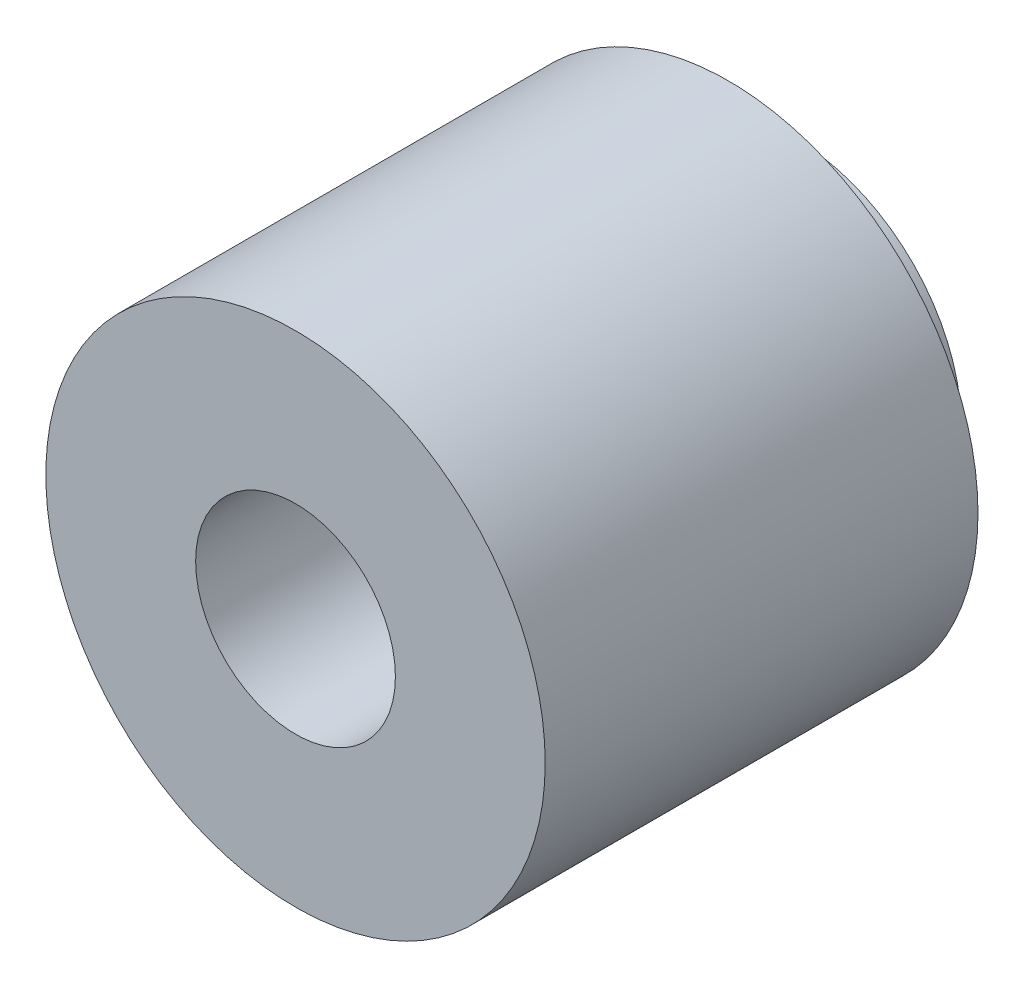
ISO-10303-21;
HEADER;
FILE_DESCRIPTION(('STEP AP214'),'2;1');
FILE_NAME('part.step','',(''),(''),'','','');
FILE_SCHEMA(('AUTOMOTIVE_DESIGN { 1 0 10303 214 1 1 1 1 }'));
ENDSEC;
DATA;
#1=APPLICATION_CONTEXT('core data for automotive mechanical design processes');
#2=APPLICATION_PROTOCOL_DEFINITION('international standard','automotive_design',2000,#1);
#3=PRODUCT_CONTEXT('',#1,'mechanical');
#4=PRODUCT('Part','Part','',(#3));
#5=PRODUCT_RELATED_PRODUCT_CATEGORY('part','',(#4));
#6=PRODUCT_DEFINITION_FORMATION('','',#4);
#7=PRODUCT_DEFINITION_CONTEXT('part definition',#1,'design');
#8=PRODUCT_DEFINITION('design','',#6,#7);
#9=PRODUCT_DEFINITION_SHAPE('','',#8);
#10=(LENGTH_UNIT() NAMED_UNIT(*) SI_UNIT(.MILLI.,.METRE.));
#11=(NAMED_UNIT(*) PLANE_ANGLE_UNIT() SI_UNIT($,.RADIAN.));
#12=(NAMED_UNIT(*) SI_UNIT($,.STERADIAN.) SOLID_ANGLE_UNIT());
#13=UNCERTAINTY_MEASURE_WITH_UNIT(LENGTH_MEASURE(1.E-05),#10,'distance_accuracy_value','');
#14=(GEOMETRIC_REPRESENTATION_CONTEXT(3) GLOBAL_UNCERTAINTY_ASSIGNED_CONTEXT((#13)) GLOBAL_UNIT_ASSIGNED_CONTEXT((#10,
#11,#12)) REPRESENTATION_CONTEXT('',''));
#15=CARTESIAN_POINT('',(0.,0.,0.));
#16=DIRECTION('',(0.,0.,1.));
#17=DIRECTION('',(1.,0.,0.));
#18=AXIS2_PLACEMENT_3D('',#15,#16,#17);
#19=CARTESIAN_POINT('',(0.,0.,50.));
#20=DIRECTION('',(0.,0.,1.));
#21=DIRECTION('',(1.,0.,0.));
#22=AXIS2_PLACEMENT_3D('',#19,#20,#21);
#23=CYLINDRICAL_SURFACE('',#22,15.);
#24=CARTESIAN_POINT('',(0.,0.,30.));
#25=DIRECTION('',(0.,0.,1.));
#26=DIRECTION('',(1.,0.,0.));
#27=AXIS2_PLACEMENT_3D('',#24,#25,#26);
#28=CIRCLE('',#27,15.);
#29=CARTESIAN_POINT('',(15.,0.,30.));
#30=VERTEX_POINT('',#29);
#31=EDGE_CURVE('E8',#30,#30,#28,.T.);
#32=ORIENTED_EDGE('',*,*,#31,.F.);
#33=EDGE_LOOP('',(#32));
#34=FACE_BOUND('',#33,.T.);
#35=CARTESIAN_POINT('',(0.,0.,4.));
#36=DIRECTION('',(0.,0.,-1.));
#37=DIRECTION('',(-1.,0.,0.));
#38=AXIS2_PLACEMENT_3D('',#35,#36,#37);
#39=CIRCLE('',#38,15.);
#40=CARTESIAN_POINT('',(-15.,0.,4.));
#41=VERTEX_POINT('',#40);
#42=EDGE_CURVE('E28',#41,#41,#39,.F.);
#43=ORIENTED_EDGE('',*,*,#42,.T.);
#44=EDGE_LOOP('',(#43));
#45=FACE_BOUND('',#44,.T.);
#46=ADVANCED_FACE('F12',(#34,#45),#23,.T.);
#47=CARTESIAN_POINT('',(0.,0.,30.));
#48=DIRECTION('',(0.,0.,1.));
#49=DIRECTION('',(1.,0.,0.));
#50=AXIS2_PLACEMENT_3D('',#47,#48,#49);
#51=PLANE('',#50);
#52=ORIENTED_EDGE('',*,*,#31,.T.);
#53=EDGE_LOOP('',(#52));
#54=FACE_BOUND('',#53,.T.);
#55=CARTESIAN_POINT('',(0.,0.,30.));
#56=DIRECTION('',(0.,0.,-1.));
#57=DIRECTION('',(-1.,0.,0.));
#58=AXIS2_PLACEMENT_3D('',#55,#56,#57);
#59=CIRCLE('',#58,6.);
#60=CARTESIAN_POINT('',(-6.,0.,30.));
#61=VERTEX_POINT('',#60);
#62=EDGE_CURVE('E25',#61,#61,#59,.T.);
#63=ORIENTED_EDGE('',*,*,#62,.T.);
#64=EDGE_LOOP('',(#63));
#65=FACE_BOUND('',#64,.T.);
#66=ADVANCED_FACE('F41',(#54,#65),#51,.T.);
#67=CARTESIAN_POINT('',(0.,0.,21.5));
#68=DIRECTION('',(0.,0.,1.));
#69=DIRECTION('',(1.,0.,0.));
#70=AXIS2_PLACEMENT_3D('',#67,#68,#69);
#71=CYLINDRICAL_SURFACE('',#70,6.);
#72=CARTESIAN_POINT('',(0.,0.,21.5));
#73=DIRECTION('',(0.,0.,-1.));
#74=DIRECTION('',(-1.,0.,0.));
#75=AXIS2_PLACEMENT_3D('',#72,#73,#74);
#76=CIRCLE('',#75,6.);
#77=CARTESIAN_POINT('',(-6.,0.,21.5));
#78=VERTEX_POINT('',#77);
#79=EDGE_CURVE('E20',#78,#78,#76,.T.);
#80=ORIENTED_EDGE('',*,*,#79,.T.);
#81=EDGE_LOOP('',(#80));
#82=FACE_BOUND('',#81,.T.);
#83=ORIENTED_EDGE('',*,*,#62,.F.);
#84=EDGE_LOOP('',(#83));
#85=FACE_BOUND('',#84,.T.);
#86=ADVANCED_FACE('F43',(#82,#85),#71,.F.);
#87=CARTESIAN_POINT('',(0.,0.,21.5));
#88=DIRECTION('',(0.,0.,-1.));
#89=DIRECTION('',(-1.,0.,0.));
#90=AXIS2_PLACEMENT_3D('',#87,#88,#89);
#91=PLANE('',#90);
#92=ORIENTED_EDGE('',*,*,#79,.F.);
#93=EDGE_LOOP('',(#92));
#94=FACE_BOUND('',#93,.T.);
#95=ADVANCED_FACE('F45',(#94),#91,.F.);
#96=CARTESIAN_POINT('',(0.,10.,4.));
#97=DIRECTION('',(0.,0.,-1.));
#98=DIRECTION('',(-1.,0.,0.));
#99=AXIS2_PLACEMENT_3D('',#96,#97,#98);
#100=PLANE('',#99);
#101=ORIENTED_EDGE('',*,*,#42,.F.);
#102=EDGE_LOOP('',(#101));
#103=FACE_BOUND('',#102,.T.);
#104=CARTESIAN_POINT('',(0.,0.,4.));
#105=DIRECTION('',(0.,0.,-1.));
#106=DIRECTION('',(-1.,0.,0.));
#107=AXIS2_PLACEMENT_3D('',#104,#105,#106);
#108=CIRCLE('',#107,10.);
#109=CARTESIAN_POINT('',(-10.,0.,4.));
#110=VERTEX_POINT('',#109);
#111=EDGE_CURVE('E30',#110,#110,#108,.T.);
#112=ORIENTED_EDGE('',*,*,#111,.F.);
#113=EDGE_LOOP('',(#112));
#114=FACE_BOUND('',#113,.T.);
#115=ADVANCED_FACE('F48',(#103,#114),#100,.T.);
#116=CARTESIAN_POINT('',(0.,0.,-10.));
#117=DIRECTION('',(0.,0.,-1.));
#118=DIRECTION('',(-1.,0.,0.));
#119=AXIS2_PLACEMENT_3D('',#116,#117,#118);
#120=CYLINDRICAL_SURFACE('',#119,10.);
#121=CARTESIAN_POINT('',(0.,0.,0.));
#122=DIRECTION('',(0.,0.,-1.));
#123=DIRECTION('',(-1.,0.,0.));
#124=AXIS2_PLACEMENT_3D('',#121,#122,#123);
#125=CIRCLE('',#124,10.);
#126=CARTESIAN_POINT('',(-10.,0.,0.));
#127=VERTEX_POINT('',#126);
#128=EDGE_CURVE('E16',#127,#127,#125,.F.);
#129=ORIENTED_EDGE('',*,*,#128,.T.);
#130=EDGE_LOOP('',(#129));
#131=FACE_BOUND('',#130,.T.);
#132=ORIENTED_EDGE('',*,*,#111,.T.);
#133=EDGE_LOOP('',(#132));
#134=FACE_BOUND('',#133,.T.);
#135=ADVANCED_FACE('F58',(#131,#134),#120,.T.);
#136=CARTESIAN_POINT('',(15.,0.,0.));
#137=DIRECTION('',(0.,0.,-1.));
#138=DIRECTION('',(-1.,0.,0.));
#139=AXIS2_PLACEMENT_3D('',#136,#137,#138);
#140=PLANE('',#139);
#141=ORIENTED_EDGE('',*,*,#128,.F.);
#142=EDGE_LOOP('',(#141));
#143=FACE_BOUND('',#142,.T.);
#144=ADVANCED_FACE('F14',(#143),#140,.T.);
#145=CLOSED_SHELL('',(#46,#66,#86,#95,#115,#135,#144));
#146=MANIFOLD_SOLID_BREP('B1',#145);
#147=ADVANCED_BREP_SHAPE_REPRESENTATION('',(#18,#146),#14);
#148=SHAPE_DEFINITION_REPRESENTATION(#9,#147);
ENDSEC;
END-ISO-10303-21;
